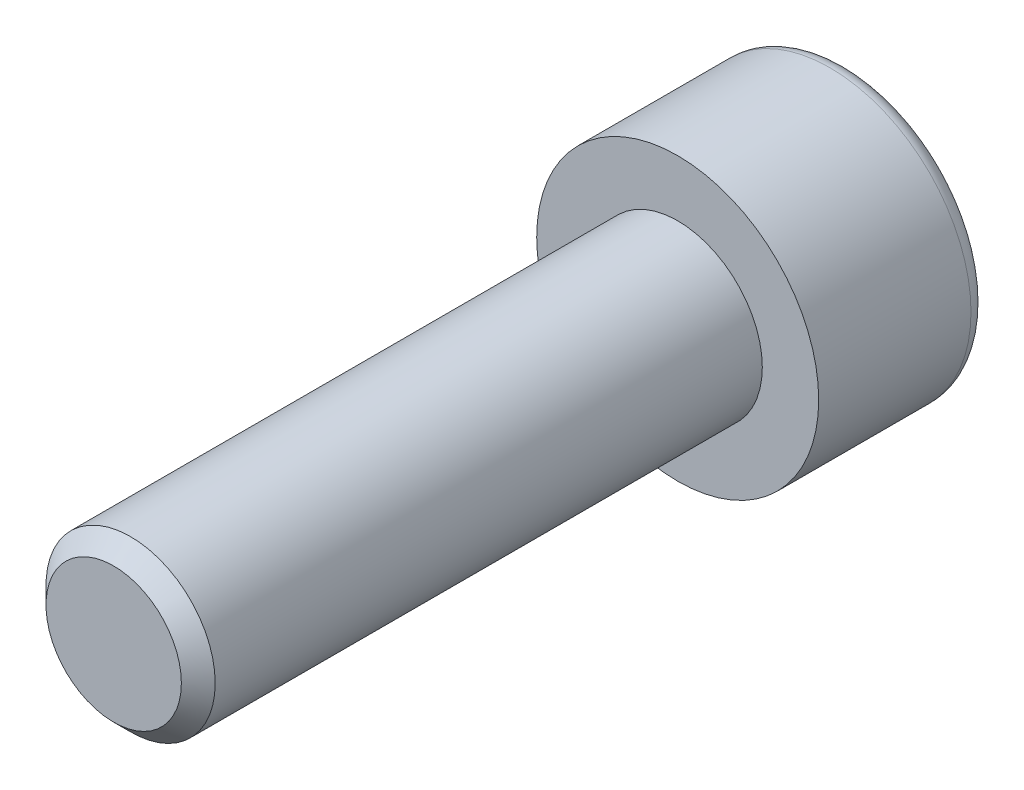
ISO-10303-21;
HEADER;
FILE_DESCRIPTION(('STEP AP214'),'2;1');
FILE_NAME('part.step','',(''),(''),'','','');
FILE_SCHEMA(('AUTOMOTIVE_DESIGN { 1 0 10303 214 1 1 1 1 }'));
ENDSEC;
DATA;
#1=APPLICATION_CONTEXT('core data for automotive mechanical design processes');
#2=APPLICATION_PROTOCOL_DEFINITION('international standard','automotive_design',2000,#1);
#3=PRODUCT_CONTEXT('',#1,'mechanical');
#4=PRODUCT('Part','Part','',(#3));
#5=PRODUCT_RELATED_PRODUCT_CATEGORY('part','',(#4));
#6=PRODUCT_DEFINITION_FORMATION('','',#4);
#7=PRODUCT_DEFINITION_CONTEXT('part definition',#1,'design');
#8=PRODUCT_DEFINITION('design','',#6,#7);
#9=PRODUCT_DEFINITION_SHAPE('','',#8);
#10=(LENGTH_UNIT() NAMED_UNIT(*) SI_UNIT(.MILLI.,.METRE.));
#11=(NAMED_UNIT(*) PLANE_ANGLE_UNIT() SI_UNIT($,.RADIAN.));
#12=(NAMED_UNIT(*) SI_UNIT($,.STERADIAN.) SOLID_ANGLE_UNIT());
#13=UNCERTAINTY_MEASURE_WITH_UNIT(LENGTH_MEASURE(1.E-05),#10,'distance_accuracy_value','');
#14=(GEOMETRIC_REPRESENTATION_CONTEXT(3) GLOBAL_UNCERTAINTY_ASSIGNED_CONTEXT((#13)) GLOBAL_UNIT_ASSIGNED_CONTEXT((#10,
#11,#12)) REPRESENTATION_CONTEXT('',''));
#15=CARTESIAN_POINT('',(0.,0.,0.));
#16=DIRECTION('',(0.,0.,1.));
#17=DIRECTION('',(1.,0.,0.));
#18=AXIS2_PLACEMENT_3D('',#15,#16,#17);
#19=CARTESIAN_POINT('',(0.,0.,-6.00000000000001));
#20=DIRECTION('',(0.,0.,1.));
#21=DIRECTION('',(1.,0.,0.));
#22=AXIS2_PLACEMENT_3D('',#19,#20,#21);
#23=PLANE('',#22);
#24=CARTESIAN_POINT('',(0.,0.,-6.00000000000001));
#25=DIRECTION('',(0.,0.,-1.));
#26=DIRECTION('',(-1.,0.,0.));
#27=AXIS2_PLACEMENT_3D('',#24,#25,#26);
#28=CIRCLE('',#27,4.4);
#29=CARTESIAN_POINT('',(-4.4,0.,-6.00000000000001));
#30=VERTEX_POINT('',#29);
#31=EDGE_CURVE('E138',#30,#30,#28,.T.);
#32=ORIENTED_EDGE('',*,*,#31,.T.);
#33=EDGE_LOOP('',(#32));
#34=FACE_BOUND('',#33,.T.);
#35=DIRECTION('',(-0.866025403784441,0.499999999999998,0.));
#36=VECTOR('',#35,1.);
#37=CARTESIAN_POINT('',(0.,2.88675134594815,-6.00000000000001));
#38=LINE('',#37,#36);
#39=CARTESIAN_POINT('',(2.49999999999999,1.44337567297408,-6.00000000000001));
#40=VERTEX_POINT('',#39);
#41=CARTESIAN_POINT('',(0.,2.88675134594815,-6.00000000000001));
#42=VERTEX_POINT('',#41);
#43=EDGE_CURVE('E42',#40,#42,#38,.T.);
#44=ORIENTED_EDGE('',*,*,#43,.T.);
#45=DIRECTION('',(-0.866025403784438,-0.500000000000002,0.));
#46=VECTOR('',#45,1.);
#47=CARTESIAN_POINT('',(0.,2.88675134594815,-6.00000000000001));
#48=LINE('',#47,#46);
#49=CARTESIAN_POINT('',(-2.50000000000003,1.44337567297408,-6.00000000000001));
#50=VERTEX_POINT('',#49);
#51=EDGE_CURVE('E82',#42,#50,#48,.T.);
#52=ORIENTED_EDGE('',*,*,#51,.T.);
#53=DIRECTION('',(0.,-1.,0.));
#54=VECTOR('',#53,1.);
#55=CARTESIAN_POINT('',(-2.50000000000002,-1.44337567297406,-6.00000000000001));
#56=LINE('',#55,#54);
#57=CARTESIAN_POINT('',(-2.50000000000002,-1.44337567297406,-6.00000000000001));
#58=VERTEX_POINT('',#57);
#59=EDGE_CURVE('E90',#50,#58,#56,.T.);
#60=ORIENTED_EDGE('',*,*,#59,.T.);
#61=DIRECTION('',(0.866025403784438,-0.500000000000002,0.));
#62=VECTOR('',#61,1.);
#63=CARTESIAN_POINT('',(0.,-2.88675134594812,-6.00000000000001));
#64=LINE('',#63,#62);
#65=CARTESIAN_POINT('',(0.,-2.88675134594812,-6.00000000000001));
#66=VERTEX_POINT('',#65);
#67=EDGE_CURVE('E108',#58,#66,#64,.T.);
#68=ORIENTED_EDGE('',*,*,#67,.T.);
#69=DIRECTION('',(0.866025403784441,0.499999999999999,0.));
#70=VECTOR('',#69,1.);
#71=CARTESIAN_POINT('',(0.,-2.88675134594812,-6.00000000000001));
#72=LINE('',#71,#70);
#73=CARTESIAN_POINT('',(2.50000000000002,-1.44337567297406,-6.00000000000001));
#74=VERTEX_POINT('',#73);
#75=EDGE_CURVE('E111',#66,#74,#72,.T.);
#76=ORIENTED_EDGE('',*,*,#75,.T.);
#77=DIRECTION('',(0.,1.,0.));
#78=VECTOR('',#77,1.);
#79=CARTESIAN_POINT('',(2.50000000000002,-1.44337567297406,-6.00000000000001));
#80=LINE('',#79,#78);
#81=EDGE_CURVE('E101',#74,#40,#80,.T.);
#82=ORIENTED_EDGE('',*,*,#81,.T.);
#83=EDGE_LOOP('',(#44,#52,#60,#68,#76,#82));
#84=FACE_BOUND('',#83,.T.);
#85=ADVANCED_FACE('F28',(#34,#84),#23,.F.);
#86=CARTESIAN_POINT('',(0.,0.,-5.4));
#87=DIRECTION('',(0.,0.,-1.));
#88=DIRECTION('',(-1.,0.,0.));
#89=AXIS2_PLACEMENT_3D('',#86,#87,#88);
#90=TOROIDAL_SURFACE('',#89,4.4,0.600000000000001);
#91=ORIENTED_EDGE('',*,*,#31,.F.);
#92=EDGE_LOOP('',(#91));
#93=FACE_BOUND('',#92,.T.);
#94=CARTESIAN_POINT('',(0.,0.,-5.4));
#95=DIRECTION('',(0.,0.,-1.));
#96=DIRECTION('',(-1.,0.,0.));
#97=AXIS2_PLACEMENT_3D('',#94,#95,#96);
#98=CIRCLE('',#97,5.);
#99=CARTESIAN_POINT('',(-5.,0.,-5.4));
#100=VERTEX_POINT('',#99);
#101=EDGE_CURVE('E135',#100,#100,#98,.T.);
#102=ORIENTED_EDGE('',*,*,#101,.T.);
#103=EDGE_LOOP('',(#102));
#104=FACE_BOUND('',#103,.T.);
#105=ADVANCED_FACE('F157',(#93,#104),#90,.T.);
#106=CARTESIAN_POINT('',(0.,0.,0.));
#107=DIRECTION('',(0.,0.,-1.));
#108=DIRECTION('',(-1.,0.,0.));
#109=AXIS2_PLACEMENT_3D('',#106,#107,#108);
#110=CYLINDRICAL_SURFACE('',#109,5.);
#111=ORIENTED_EDGE('',*,*,#101,.F.);
#112=EDGE_LOOP('',(#111));
#113=FACE_BOUND('',#112,.T.);
#114=CARTESIAN_POINT('',(0.,0.,0.));
#115=DIRECTION('',(0.,0.,-1.));
#116=DIRECTION('',(-1.,0.,0.));
#117=AXIS2_PLACEMENT_3D('',#114,#115,#116);
#118=CIRCLE('',#117,5.);
#119=CARTESIAN_POINT('',(-5.00000000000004,0.,0.));
#120=VERTEX_POINT('',#119);
#121=EDGE_CURVE('E96',#120,#120,#118,.T.);
#122=ORIENTED_EDGE('',*,*,#121,.T.);
#123=EDGE_LOOP('',(#122));
#124=FACE_BOUND('',#123,.T.);
#125=ADVANCED_FACE('F162',(#113,#124),#110,.T.);
#126=CARTESIAN_POINT('',(0.,0.,0.));
#127=DIRECTION('',(0.,0.,-1.));
#128=DIRECTION('',(-1.,0.,0.));
#129=AXIS2_PLACEMENT_3D('',#126,#127,#128);
#130=PLANE('',#129);
#131=CARTESIAN_POINT('',(0.,0.,0.));
#132=DIRECTION('',(0.,0.,1.));
#133=DIRECTION('',(1.,0.,0.));
#134=AXIS2_PLACEMENT_3D('',#131,#132,#133);
#135=CIRCLE('',#134,3.);
#136=CARTESIAN_POINT('',(2.99999999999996,0.,0.));
#137=VERTEX_POINT('',#136);
#138=EDGE_CURVE('E102',#137,#137,#135,.T.);
#139=ORIENTED_EDGE('',*,*,#138,.F.);
#140=EDGE_LOOP('',(#139));
#141=FACE_BOUND('',#140,.T.);
#142=ORIENTED_EDGE('',*,*,#121,.F.);
#143=EDGE_LOOP('',(#142));
#144=FACE_BOUND('',#143,.T.);
#145=ADVANCED_FACE('F170',(#141,#144),#130,.F.);
#146=CARTESIAN_POINT('',(0.,2.88675134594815,-3.));
#147=DIRECTION('',(-0.499999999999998,-0.86602540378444,0.));
#148=DIRECTION('',(0.866025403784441,-0.499999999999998,0.));
#149=AXIS2_PLACEMENT_3D('',#146,#147,#148);
#150=PLANE('',#149);
#151=ORIENTED_EDGE('',*,*,#43,.F.);
#152=DIRECTION('',(0.,0.,-1.));
#153=VECTOR('',#152,1.);
#154=CARTESIAN_POINT('',(2.49999999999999,1.44337567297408,-3.));
#155=LINE('',#154,#153);
#156=CARTESIAN_POINT('',(2.49999999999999,1.44337567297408,-3.));
#157=VERTEX_POINT('',#156);
#158=EDGE_CURVE('E124',#157,#40,#155,.T.);
#159=ORIENTED_EDGE('',*,*,#158,.F.);
#160=DIRECTION('',(-0.866025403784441,0.499999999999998,0.));
#161=VECTOR('',#160,1.);
#162=CARTESIAN_POINT('',(0.,2.88675134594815,-3.));
#163=LINE('',#162,#161);
#164=CARTESIAN_POINT('',(0.,2.88675134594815,-3.));
#165=VERTEX_POINT('',#164);
#166=EDGE_CURVE('E95',#157,#165,#163,.T.);
#167=ORIENTED_EDGE('',*,*,#166,.T.);
#168=DIRECTION('',(0.,0.,-1.));
#169=VECTOR('',#168,1.);
#170=CARTESIAN_POINT('',(0.,2.88675134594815,-3.));
#171=LINE('',#170,#169);
#172=EDGE_CURVE('E84',#165,#42,#171,.T.);
#173=ORIENTED_EDGE('',*,*,#172,.T.);
#174=EDGE_LOOP('',(#151,#159,#167,#173));
#175=FACE_BOUND('',#174,.T.);
#176=ADVANCED_FACE('F93',(#175),#150,.T.);
#177=CARTESIAN_POINT('',(0.,2.88675134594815,-3.));
#178=DIRECTION('',(0.500000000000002,-0.866025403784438,0.));
#179=DIRECTION('',(0.866025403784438,0.500000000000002,0.));
#180=AXIS2_PLACEMENT_3D('',#177,#178,#179);
#181=PLANE('',#180);
#182=ORIENTED_EDGE('',*,*,#51,.F.);
#183=ORIENTED_EDGE('',*,*,#172,.F.);
#184=DIRECTION('',(-0.866025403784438,-0.500000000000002,0.));
#185=VECTOR('',#184,1.);
#186=CARTESIAN_POINT('',(0.,2.88675134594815,-3.));
#187=LINE('',#186,#185);
#188=CARTESIAN_POINT('',(-2.50000000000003,1.44337567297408,-3.));
#189=VERTEX_POINT('',#188);
#190=EDGE_CURVE('E115',#165,#189,#187,.T.);
#191=ORIENTED_EDGE('',*,*,#190,.T.);
#192=DIRECTION('',(0.,0.,-1.));
#193=VECTOR('',#192,1.);
#194=CARTESIAN_POINT('',(-2.50000000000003,1.44337567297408,-3.));
#195=LINE('',#194,#193);
#196=EDGE_CURVE('E86',#189,#50,#195,.T.);
#197=ORIENTED_EDGE('',*,*,#196,.T.);
#198=EDGE_LOOP('',(#182,#183,#191,#197));
#199=FACE_BOUND('',#198,.T.);
#200=ADVANCED_FACE('F83',(#199),#181,.T.);
#201=CARTESIAN_POINT('',(-2.50000000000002,-1.44337567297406,-3.));
#202=DIRECTION('',(1.,0.,0.));
#203=DIRECTION('',(0.,0.,-1.));
#204=AXIS2_PLACEMENT_3D('',#201,#202,#203);
#205=PLANE('',#204);
#206=ORIENTED_EDGE('',*,*,#59,.F.);
#207=ORIENTED_EDGE('',*,*,#196,.F.);
#208=DIRECTION('',(0.,-1.,0.));
#209=VECTOR('',#208,1.);
#210=CARTESIAN_POINT('',(-2.50000000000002,-1.44337567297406,-3.));
#211=LINE('',#210,#209);
#212=CARTESIAN_POINT('',(-2.50000000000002,-1.44337567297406,-3.));
#213=VERTEX_POINT('',#212);
#214=EDGE_CURVE('E117',#189,#213,#211,.T.);
#215=ORIENTED_EDGE('',*,*,#214,.T.);
#216=DIRECTION('',(0.,0.,-1.));
#217=VECTOR('',#216,1.);
#218=CARTESIAN_POINT('',(-2.50000000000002,-1.44337567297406,-3.));
#219=LINE('',#218,#217);
#220=EDGE_CURVE('E130',#213,#58,#219,.T.);
#221=ORIENTED_EDGE('',*,*,#220,.T.);
#222=EDGE_LOOP('',(#206,#207,#215,#221));
#223=FACE_BOUND('',#222,.T.);
#224=ADVANCED_FACE('F185',(#223),#205,.T.);
#225=CARTESIAN_POINT('',(0.,-2.88675134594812,-3.));
#226=DIRECTION('',(0.500000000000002,0.866025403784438,0.));
#227=DIRECTION('',(-0.866025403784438,0.500000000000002,0.));
#228=AXIS2_PLACEMENT_3D('',#225,#226,#227);
#229=PLANE('',#228);
#230=ORIENTED_EDGE('',*,*,#67,.F.);
#231=ORIENTED_EDGE('',*,*,#220,.F.);
#232=DIRECTION('',(0.866025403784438,-0.500000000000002,0.));
#233=VECTOR('',#232,1.);
#234=CARTESIAN_POINT('',(0.,-2.88675134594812,-3.));
#235=LINE('',#234,#233);
#236=CARTESIAN_POINT('',(0.,-2.88675134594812,-3.));
#237=VERTEX_POINT('',#236);
#238=EDGE_CURVE('E119',#213,#237,#235,.T.);
#239=ORIENTED_EDGE('',*,*,#238,.T.);
#240=DIRECTION('',(0.,0.,-1.));
#241=VECTOR('',#240,1.);
#242=CARTESIAN_POINT('',(0.,-2.88675134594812,-3.));
#243=LINE('',#242,#241);
#244=EDGE_CURVE('E128',#237,#66,#243,.T.);
#245=ORIENTED_EDGE('',*,*,#244,.T.);
#246=EDGE_LOOP('',(#230,#231,#239,#245));
#247=FACE_BOUND('',#246,.T.);
#248=ADVANCED_FACE('F188',(#247),#229,.T.);
#249=CARTESIAN_POINT('',(0.,-2.88675134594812,-3.));
#250=DIRECTION('',(-0.499999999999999,0.866025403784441,0.));
#251=DIRECTION('',(-0.866025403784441,-0.499999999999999,0.));
#252=AXIS2_PLACEMENT_3D('',#249,#250,#251);
#253=PLANE('',#252);
#254=ORIENTED_EDGE('',*,*,#75,.F.);
#255=ORIENTED_EDGE('',*,*,#244,.F.);
#256=DIRECTION('',(0.866025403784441,0.499999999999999,0.));
#257=VECTOR('',#256,1.);
#258=CARTESIAN_POINT('',(0.,-2.88675134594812,-3.));
#259=LINE('',#258,#257);
#260=CARTESIAN_POINT('',(2.50000000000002,-1.44337567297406,-3.));
#261=VERTEX_POINT('',#260);
#262=EDGE_CURVE('E121',#237,#261,#259,.T.);
#263=ORIENTED_EDGE('',*,*,#262,.T.);
#264=DIRECTION('',(0.,0.,-1.));
#265=VECTOR('',#264,1.);
#266=CARTESIAN_POINT('',(2.50000000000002,-1.44337567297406,-3.));
#267=LINE('',#266,#265);
#268=EDGE_CURVE('E126',#261,#74,#267,.T.);
#269=ORIENTED_EDGE('',*,*,#268,.T.);
#270=EDGE_LOOP('',(#254,#255,#263,#269));
#271=FACE_BOUND('',#270,.T.);
#272=ADVANCED_FACE('F192',(#271),#253,.T.);
#273=CARTESIAN_POINT('',(2.50000000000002,-1.44337567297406,-3.));
#274=DIRECTION('',(-1.,0.,0.));
#275=DIRECTION('',(0.,0.,1.));
#276=AXIS2_PLACEMENT_3D('',#273,#274,#275);
#277=PLANE('',#276);
#278=ORIENTED_EDGE('',*,*,#81,.F.);
#279=ORIENTED_EDGE('',*,*,#268,.F.);
#280=DIRECTION('',(0.,1.,0.));
#281=VECTOR('',#280,1.);
#282=CARTESIAN_POINT('',(2.50000000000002,-1.44337567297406,-3.));
#283=LINE('',#282,#281);
#284=EDGE_CURVE('E49',#261,#157,#283,.T.);
#285=ORIENTED_EDGE('',*,*,#284,.T.);
#286=ORIENTED_EDGE('',*,*,#158,.T.);
#287=EDGE_LOOP('',(#278,#279,#285,#286));
#288=FACE_BOUND('',#287,.T.);
#289=ADVANCED_FACE('F196',(#288),#277,.T.);
#290=CARTESIAN_POINT('',(2.49999999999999,1.44337567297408,-3.));
#291=DIRECTION('',(0.,0.,1.));
#292=DIRECTION('',(1.,0.,0.));
#293=AXIS2_PLACEMENT_3D('',#290,#291,#292);
#294=PLANE('',#293);
#295=ORIENTED_EDGE('',*,*,#166,.F.);
#296=ORIENTED_EDGE('',*,*,#284,.F.);
#297=ORIENTED_EDGE('',*,*,#262,.F.);
#298=ORIENTED_EDGE('',*,*,#238,.F.);
#299=ORIENTED_EDGE('',*,*,#214,.F.);
#300=ORIENTED_EDGE('',*,*,#190,.F.);
#301=EDGE_LOOP('',(#295,#296,#297,#298,#299,#300));
#302=FACE_BOUND('',#301,.T.);
#303=ADVANCED_FACE('F200',(#302),#294,.F.);
#304=CARTESIAN_POINT('',(0.,0.,20.));
#305=DIRECTION('',(0.,0.,1.));
#306=DIRECTION('',(1.,0.,0.));
#307=AXIS2_PLACEMENT_3D('',#304,#305,#306);
#308=PLANE('',#307);
#309=CARTESIAN_POINT('',(0.,0.,20.));
#310=DIRECTION('',(0.,0.,1.));
#311=DIRECTION('',(1.,0.,0.));
#312=AXIS2_PLACEMENT_3D('',#309,#310,#311);
#313=CIRCLE('',#312,2.4);
#314=CARTESIAN_POINT('',(2.39999999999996,0.,20.));
#315=VERTEX_POINT('',#314);
#316=EDGE_CURVE('E35',#315,#315,#313,.T.);
#317=ORIENTED_EDGE('',*,*,#316,.T.);
#318=EDGE_LOOP('',(#317));
#319=FACE_BOUND('',#318,.T.);
#320=ADVANCED_FACE('F143',(#319),#308,.T.);
#321=CARTESIAN_POINT('',(0.,0.,0.));
#322=DIRECTION('',(0.,0.,1.));
#323=DIRECTION('',(1.,0.,0.));
#324=AXIS2_PLACEMENT_3D('',#321,#322,#323);
#325=CYLINDRICAL_SURFACE('',#324,3.);
#326=CARTESIAN_POINT('',(0.,0.,19.4));
#327=DIRECTION('',(0.,0.,1.));
#328=DIRECTION('',(1.,0.,0.));
#329=AXIS2_PLACEMENT_3D('',#326,#327,#328);
#330=CIRCLE('',#329,3.);
#331=CARTESIAN_POINT('',(2.99999999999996,0.,19.4));
#332=VERTEX_POINT('',#331);
#333=EDGE_CURVE('E11',#332,#332,#330,.F.);
#334=ORIENTED_EDGE('',*,*,#333,.T.);
#335=EDGE_LOOP('',(#334));
#336=FACE_BOUND('',#335,.T.);
#337=ORIENTED_EDGE('',*,*,#138,.T.);
#338=EDGE_LOOP('',(#337));
#339=FACE_BOUND('',#338,.T.);
#340=ADVANCED_FACE('F147',(#336,#339),#325,.T.);
#341=CARTESIAN_POINT('',(0.,0.,20.));
#342=DIRECTION('',(0.,0.,-1.));
#343=DIRECTION('',(-1.,0.,0.));
#344=AXIS2_PLACEMENT_3D('',#341,#342,#343);
#345=CONICAL_SURFACE('',#344,2.4,0.785398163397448);
#346=ORIENTED_EDGE('',*,*,#333,.F.);
#347=EDGE_LOOP('',(#346));
#348=FACE_BOUND('',#347,.T.);
#349=ORIENTED_EDGE('',*,*,#316,.F.);
#350=EDGE_LOOP('',(#349));
#351=FACE_BOUND('',#350,.T.);
#352=ADVANCED_FACE('F145',(#348,#351),#345,.T.);
#353=CLOSED_SHELL('',(#85,#105,#125,#145,#176,#200,#224,#248,#272,#289,#303,#320,#340,#352));
#354=MANIFOLD_SOLID_BREP('B2',#353);
#355=ADVANCED_BREP_SHAPE_REPRESENTATION('',(#18,#354),#14);
#356=SHAPE_DEFINITION_REPRESENTATION(#9,#355);
ENDSEC;
END-ISO-10303-21;
